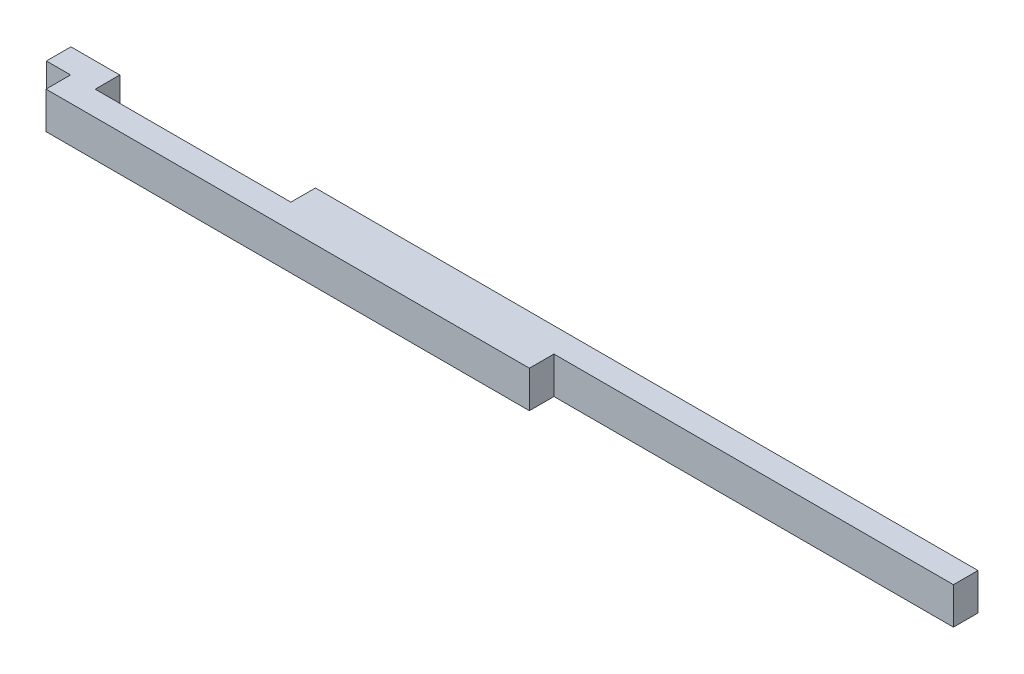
ISO-10303-21;
HEADER;
FILE_DESCRIPTION(('STEP AP214'),'2;1');
FILE_NAME('part.step','',(''),(''),'','','');
FILE_SCHEMA(('AUTOMOTIVE_DESIGN { 1 0 10303 214 1 1 1 1 }'));
ENDSEC;
DATA;
#1=APPLICATION_CONTEXT('core data for automotive mechanical design processes');
#2=APPLICATION_PROTOCOL_DEFINITION('international standard','automotive_design',2000,#1);
#3=PRODUCT_CONTEXT('',#1,'mechanical');
#4=PRODUCT('Part','Part','',(#3));
#5=PRODUCT_RELATED_PRODUCT_CATEGORY('part','',(#4));
#6=PRODUCT_DEFINITION_FORMATION('','',#4);
#7=PRODUCT_DEFINITION_CONTEXT('part definition',#1,'design');
#8=PRODUCT_DEFINITION('design','',#6,#7);
#9=PRODUCT_DEFINITION_SHAPE('','',#8);
#10=(LENGTH_UNIT() NAMED_UNIT(*) SI_UNIT(.MILLI.,.METRE.));
#11=(NAMED_UNIT(*) PLANE_ANGLE_UNIT() SI_UNIT($,.RADIAN.));
#12=(NAMED_UNIT(*) SI_UNIT($,.STERADIAN.) SOLID_ANGLE_UNIT());
#13=UNCERTAINTY_MEASURE_WITH_UNIT(LENGTH_MEASURE(1.E-05),#10,'distance_accuracy_value','');
#14=(GEOMETRIC_REPRESENTATION_CONTEXT(3) GLOBAL_UNCERTAINTY_ASSIGNED_CONTEXT((#13)) GLOBAL_UNIT_ASSIGNED_CONTEXT((#10,
#11,#12)) REPRESENTATION_CONTEXT('',''));
#15=CARTESIAN_POINT('',(0.,0.,0.));
#16=DIRECTION('',(0.,0.,1.));
#17=DIRECTION('',(1.,0.,0.));
#18=AXIS2_PLACEMENT_3D('',#15,#16,#17);
#19=CARTESIAN_POINT('',(0.,152.4,0.));
#20=DIRECTION('',(1.,0.,0.));
#21=DIRECTION('',(0.,0.,-1.));
#22=AXIS2_PLACEMENT_3D('',#19,#20,#21);
#23=PLANE('',#22);
#24=DIRECTION('',(0.,0.,1.));
#25=VECTOR('',#24,1.);
#26=CARTESIAN_POINT('',(0.,0.,0.));
#27=LINE('',#26,#25);
#28=CARTESIAN_POINT('',(0.,0.,-101.6));
#29=VERTEX_POINT('',#28);
#30=CARTESIAN_POINT('',(0.,0.,0.));
#31=VERTEX_POINT('',#30);
#32=EDGE_CURVE('E154',#29,#31,#27,.T.);
#33=ORIENTED_EDGE('',*,*,#32,.T.);
#34=DIRECTION('',(0.,-1.,0.));
#35=VECTOR('',#34,1.);
#36=CARTESIAN_POINT('',(0.,152.4,0.));
#37=LINE('',#36,#35);
#38=CARTESIAN_POINT('',(0.,152.4,0.));
#39=VERTEX_POINT('',#38);
#40=EDGE_CURVE('E11',#39,#31,#37,.T.);
#41=ORIENTED_EDGE('',*,*,#40,.F.);
#42=DIRECTION('',(0.,0.,1.));
#43=VECTOR('',#42,1.);
#44=CARTESIAN_POINT('',(0.,152.4,0.));
#45=LINE('',#44,#43);
#46=CARTESIAN_POINT('',(0.,152.4,-101.6));
#47=VERTEX_POINT('',#46);
#48=EDGE_CURVE('E177',#47,#39,#45,.T.);
#49=ORIENTED_EDGE('',*,*,#48,.F.);
#50=DIRECTION('',(0.,-1.,0.));
#51=VECTOR('',#50,1.);
#52=CARTESIAN_POINT('',(0.,152.4,-101.6));
#53=LINE('',#52,#51);
#54=EDGE_CURVE('E150',#47,#29,#53,.T.);
#55=ORIENTED_EDGE('',*,*,#54,.T.);
#56=EDGE_LOOP('',(#33,#41,#49,#55));
#57=FACE_BOUND('',#56,.T.);
#58=ADVANCED_FACE('F34',(#57),#23,.F.);
#59=CARTESIAN_POINT('',(0.,152.4,0.));
#60=DIRECTION('',(0.,0.,-1.));
#61=DIRECTION('',(-1.,0.,0.));
#62=AXIS2_PLACEMENT_3D('',#59,#60,#61);
#63=PLANE('',#62);
#64=DIRECTION('',(1.,0.,0.));
#65=VECTOR('',#64,1.);
#66=CARTESIAN_POINT('',(0.,0.,0.));
#67=LINE('',#66,#65);
#68=CARTESIAN_POINT('',(100.,0.,0.));
#69=VERTEX_POINT('',#68);
#70=EDGE_CURVE('E157',#31,#69,#67,.T.);
#71=ORIENTED_EDGE('',*,*,#70,.T.);
#72=DIRECTION('',(0.,-1.,0.));
#73=VECTOR('',#72,1.);
#74=CARTESIAN_POINT('',(100.,152.4,0.));
#75=LINE('',#74,#73);
#76=CARTESIAN_POINT('',(100.,152.4,0.));
#77=VERTEX_POINT('',#76);
#78=EDGE_CURVE('E42',#77,#69,#75,.T.);
#79=ORIENTED_EDGE('',*,*,#78,.F.);
#80=DIRECTION('',(1.,0.,0.));
#81=VECTOR('',#80,1.);
#82=CARTESIAN_POINT('',(0.,152.4,0.));
#83=LINE('',#82,#81);
#84=EDGE_CURVE('E105',#39,#77,#83,.T.);
#85=ORIENTED_EDGE('',*,*,#84,.F.);
#86=ORIENTED_EDGE('',*,*,#40,.T.);
#87=EDGE_LOOP('',(#71,#79,#85,#86));
#88=FACE_BOUND('',#87,.T.);
#89=ADVANCED_FACE('F254',(#88),#63,.F.);
#90=CARTESIAN_POINT('',(100.,152.4,0.));
#91=DIRECTION('',(1.,0.,0.));
#92=DIRECTION('',(0.,0.,-1.));
#93=AXIS2_PLACEMENT_3D('',#90,#91,#92);
#94=PLANE('',#93);
#95=DIRECTION('',(0.,0.,1.));
#96=VECTOR('',#95,1.);
#97=CARTESIAN_POINT('',(100.,0.,0.));
#98=LINE('',#97,#96);
#99=CARTESIAN_POINT('',(100.,0.,101.6));
#100=VERTEX_POINT('',#99);
#101=EDGE_CURVE('E159',#69,#100,#98,.T.);
#102=ORIENTED_EDGE('',*,*,#101,.T.);
#103=DIRECTION('',(0.,-1.,0.));
#104=VECTOR('',#103,1.);
#105=CARTESIAN_POINT('',(100.,152.4,101.6));
#106=LINE('',#105,#104);
#107=CARTESIAN_POINT('',(100.,152.4,101.6));
#108=VERTEX_POINT('',#107);
#109=EDGE_CURVE('E196',#108,#100,#106,.T.);
#110=ORIENTED_EDGE('',*,*,#109,.F.);
#111=DIRECTION('',(0.,0.,1.));
#112=VECTOR('',#111,1.);
#113=CARTESIAN_POINT('',(100.,152.4,0.));
#114=LINE('',#113,#112);
#115=EDGE_CURVE('E204',#77,#108,#114,.T.);
#116=ORIENTED_EDGE('',*,*,#115,.F.);
#117=ORIENTED_EDGE('',*,*,#78,.T.);
#118=EDGE_LOOP('',(#102,#110,#116,#117));
#119=FACE_BOUND('',#118,.T.);
#120=ADVANCED_FACE('F202',(#119),#94,.F.);
#121=CARTESIAN_POINT('',(1100.,152.4,101.6));
#122=DIRECTION('',(0.,0.,-1.));
#123=DIRECTION('',(-1.,0.,0.));
#124=AXIS2_PLACEMENT_3D('',#121,#122,#123);
#125=PLANE('',#124);
#126=DIRECTION('',(1.,0.,0.));
#127=VECTOR('',#126,1.);
#128=CARTESIAN_POINT('',(1100.,0.,101.6));
#129=LINE('',#128,#127);
#130=CARTESIAN_POINT('',(2100.,0.,101.6));
#131=VERTEX_POINT('',#130);
#132=EDGE_CURVE('E162',#100,#131,#129,.T.);
#133=ORIENTED_EDGE('',*,*,#132,.T.);
#134=DIRECTION('',(0.,-1.,0.));
#135=VECTOR('',#134,1.);
#136=CARTESIAN_POINT('',(2100.,152.4,101.6));
#137=LINE('',#136,#135);
#138=CARTESIAN_POINT('',(2100.,152.4,101.6));
#139=VERTEX_POINT('',#138);
#140=EDGE_CURVE('E193',#139,#131,#137,.T.);
#141=ORIENTED_EDGE('',*,*,#140,.F.);
#142=DIRECTION('',(1.,0.,0.));
#143=VECTOR('',#142,1.);
#144=CARTESIAN_POINT('',(100.,152.4,101.6));
#145=LINE('',#144,#143);
#146=EDGE_CURVE('E221',#108,#139,#145,.T.);
#147=ORIENTED_EDGE('',*,*,#146,.F.);
#148=ORIENTED_EDGE('',*,*,#109,.T.);
#149=EDGE_LOOP('',(#133,#141,#147,#148));
#150=FACE_BOUND('',#149,.T.);
#151=ADVANCED_FACE('F212',(#150),#125,.F.);
#152=CARTESIAN_POINT('',(2100.,152.4,0.));
#153=DIRECTION('',(-1.,0.,0.));
#154=DIRECTION('',(0.,0.,1.));
#155=AXIS2_PLACEMENT_3D('',#152,#153,#154);
#156=PLANE('',#155);
#157=DIRECTION('',(0.,0.,-1.));
#158=VECTOR('',#157,1.);
#159=CARTESIAN_POINT('',(2100.,0.,0.));
#160=LINE('',#159,#158);
#161=CARTESIAN_POINT('',(2100.,0.,0.));
#162=VERTEX_POINT('',#161);
#163=EDGE_CURVE('E164',#131,#162,#160,.T.);
#164=ORIENTED_EDGE('',*,*,#163,.T.);
#165=DIRECTION('',(0.,-1.,0.));
#166=VECTOR('',#165,1.);
#167=CARTESIAN_POINT('',(2100.,152.4,0.));
#168=LINE('',#167,#166);
#169=CARTESIAN_POINT('',(2100.,152.4,0.));
#170=VERTEX_POINT('',#169);
#171=EDGE_CURVE('E190',#170,#162,#168,.T.);
#172=ORIENTED_EDGE('',*,*,#171,.F.);
#173=DIRECTION('',(0.,0.,-1.));
#174=VECTOR('',#173,1.);
#175=CARTESIAN_POINT('',(2100.,152.4,0.));
#176=LINE('',#175,#174);
#177=EDGE_CURVE('E218',#139,#170,#176,.T.);
#178=ORIENTED_EDGE('',*,*,#177,.F.);
#179=ORIENTED_EDGE('',*,*,#140,.T.);
#180=EDGE_LOOP('',(#164,#172,#178,#179));
#181=FACE_BOUND('',#180,.T.);
#182=ADVANCED_FACE('F216',(#181),#156,.F.);
#183=CARTESIAN_POINT('',(2100.,152.4,0.));
#184=DIRECTION('',(0.,0.,-1.));
#185=DIRECTION('',(-1.,0.,0.));
#186=AXIS2_PLACEMENT_3D('',#183,#184,#185);
#187=PLANE('',#186);
#188=DIRECTION('',(1.,0.,0.));
#189=VECTOR('',#188,1.);
#190=CARTESIAN_POINT('',(2100.,0.,0.));
#191=LINE('',#190,#189);
#192=CARTESIAN_POINT('',(3752.9406,0.,0.));
#193=VERTEX_POINT('',#192);
#194=EDGE_CURVE('E166',#162,#193,#191,.T.);
#195=ORIENTED_EDGE('',*,*,#194,.T.);
#196=DIRECTION('',(0.,-1.,0.));
#197=VECTOR('',#196,1.);
#198=CARTESIAN_POINT('',(3752.9406,152.4,0.));
#199=LINE('',#198,#197);
#200=CARTESIAN_POINT('',(3752.9406,152.4,0.));
#201=VERTEX_POINT('',#200);
#202=EDGE_CURVE('E187',#201,#193,#199,.T.);
#203=ORIENTED_EDGE('',*,*,#202,.F.);
#204=DIRECTION('',(1.,0.,0.));
#205=VECTOR('',#204,1.);
#206=CARTESIAN_POINT('',(2100.,152.4,0.));
#207=LINE('',#206,#205);
#208=EDGE_CURVE('E220',#170,#201,#207,.T.);
#209=ORIENTED_EDGE('',*,*,#208,.F.);
#210=ORIENTED_EDGE('',*,*,#171,.T.);
#211=EDGE_LOOP('',(#195,#203,#209,#210));
#212=FACE_BOUND('',#211,.T.);
#213=ADVANCED_FACE('F267',(#212),#187,.F.);
#214=CARTESIAN_POINT('',(3752.9406,152.4,0.));
#215=DIRECTION('',(-1.,0.,0.));
#216=DIRECTION('',(0.,0.,1.));
#217=AXIS2_PLACEMENT_3D('',#214,#215,#216);
#218=PLANE('',#217);
#219=DIRECTION('',(0.,0.,-1.));
#220=VECTOR('',#219,1.);
#221=CARTESIAN_POINT('',(3752.9406,0.,0.));
#222=LINE('',#221,#220);
#223=CARTESIAN_POINT('',(3752.9406,0.,-101.6));
#224=VERTEX_POINT('',#223);
#225=EDGE_CURVE('E168',#193,#224,#222,.T.);
#226=ORIENTED_EDGE('',*,*,#225,.T.);
#227=DIRECTION('',(0.,-1.,0.));
#228=VECTOR('',#227,1.);
#229=CARTESIAN_POINT('',(3752.9406,152.4,-101.6));
#230=LINE('',#229,#228);
#231=CARTESIAN_POINT('',(3752.9406,152.4,-101.6));
#232=VERTEX_POINT('',#231);
#233=EDGE_CURVE('E184',#232,#224,#230,.T.);
#234=ORIENTED_EDGE('',*,*,#233,.F.);
#235=DIRECTION('',(0.,0.,-1.));
#236=VECTOR('',#235,1.);
#237=CARTESIAN_POINT('',(3752.9406,152.4,0.));
#238=LINE('',#237,#236);
#239=EDGE_CURVE('E223',#201,#232,#238,.T.);
#240=ORIENTED_EDGE('',*,*,#239,.F.);
#241=ORIENTED_EDGE('',*,*,#202,.T.);
#242=EDGE_LOOP('',(#226,#234,#240,#241));
#243=FACE_BOUND('',#242,.T.);
#244=ADVANCED_FACE('F270',(#243),#218,.F.);
#245=CARTESIAN_POINT('',(1011.56,152.4,-101.6));
#246=DIRECTION('',(0.,0.,1.));
#247=DIRECTION('',(1.,0.,0.));
#248=AXIS2_PLACEMENT_3D('',#245,#246,#247);
#249=PLANE('',#248);
#250=DIRECTION('',(-1.,0.,0.));
#251=VECTOR('',#250,1.);
#252=CARTESIAN_POINT('',(1011.56,0.,-101.6));
#253=LINE('',#252,#251);
#254=CARTESIAN_POINT('',(1011.56,0.,-101.6));
#255=VERTEX_POINT('',#254);
#256=EDGE_CURVE('E170',#224,#255,#253,.T.);
#257=ORIENTED_EDGE('',*,*,#256,.T.);
#258=DIRECTION('',(0.,-1.,0.));
#259=VECTOR('',#258,1.);
#260=CARTESIAN_POINT('',(1011.56,152.4,-101.6));
#261=LINE('',#260,#259);
#262=CARTESIAN_POINT('',(1011.56,152.4,-101.6));
#263=VERTEX_POINT('',#262);
#264=EDGE_CURVE('E181',#263,#255,#261,.T.);
#265=ORIENTED_EDGE('',*,*,#264,.F.);
#266=DIRECTION('',(-1.,0.,0.));
#267=VECTOR('',#266,1.);
#268=CARTESIAN_POINT('',(1011.56,152.4,-101.6));
#269=LINE('',#268,#267);
#270=EDGE_CURVE('E229',#232,#263,#269,.T.);
#271=ORIENTED_EDGE('',*,*,#270,.F.);
#272=ORIENTED_EDGE('',*,*,#233,.T.);
#273=EDGE_LOOP('',(#257,#265,#271,#272));
#274=FACE_BOUND('',#273,.T.);
#275=ADVANCED_FACE('F235',(#274),#249,.F.);
#276=CARTESIAN_POINT('',(1011.56,152.4,0.));
#277=DIRECTION('',(1.,0.,0.));
#278=DIRECTION('',(0.,0.,-1.));
#279=AXIS2_PLACEMENT_3D('',#276,#277,#278);
#280=PLANE('',#279);
#281=DIRECTION('',(0.,0.,1.));
#282=VECTOR('',#281,1.);
#283=CARTESIAN_POINT('',(1011.56,0.,0.));
#284=LINE('',#283,#282);
#285=CARTESIAN_POINT('',(1011.56,0.,0.));
#286=VERTEX_POINT('',#285);
#287=EDGE_CURVE('E172',#255,#286,#284,.T.);
#288=ORIENTED_EDGE('',*,*,#287,.T.);
#289=DIRECTION('',(0.,-1.,0.));
#290=VECTOR('',#289,1.);
#291=CARTESIAN_POINT('',(1011.56,152.4,0.));
#292=LINE('',#291,#290);
#293=CARTESIAN_POINT('',(1011.56,152.4,0.));
#294=VERTEX_POINT('',#293);
#295=EDGE_CURVE('E145',#294,#286,#292,.T.);
#296=ORIENTED_EDGE('',*,*,#295,.F.);
#297=DIRECTION('',(0.,0.,1.));
#298=VECTOR('',#297,1.);
#299=CARTESIAN_POINT('',(1011.56,152.4,0.));
#300=LINE('',#299,#298);
#301=EDGE_CURVE('E136',#263,#294,#300,.T.);
#302=ORIENTED_EDGE('',*,*,#301,.F.);
#303=ORIENTED_EDGE('',*,*,#264,.T.);
#304=EDGE_LOOP('',(#288,#296,#302,#303));
#305=FACE_BOUND('',#304,.T.);
#306=ADVANCED_FACE('F239',(#305),#280,.F.);
#307=CARTESIAN_POINT('',(202.,152.4,0.));
#308=DIRECTION('',(0.,0.,1.));
#309=DIRECTION('',(1.,0.,0.));
#310=AXIS2_PLACEMENT_3D('',#307,#308,#309);
#311=PLANE('',#310);
#312=DIRECTION('',(-1.,0.,0.));
#313=VECTOR('',#312,1.);
#314=CARTESIAN_POINT('',(202.,0.,0.));
#315=LINE('',#314,#313);
#316=CARTESIAN_POINT('',(202.,0.,0.));
#317=VERTEX_POINT('',#316);
#318=EDGE_CURVE('E144',#286,#317,#315,.T.);
#319=ORIENTED_EDGE('',*,*,#318,.T.);
#320=DIRECTION('',(0.,-1.,0.));
#321=VECTOR('',#320,1.);
#322=CARTESIAN_POINT('',(202.,152.4,0.));
#323=LINE('',#322,#321);
#324=CARTESIAN_POINT('',(202.,152.4,0.));
#325=VERTEX_POINT('',#324);
#326=EDGE_CURVE('E141',#325,#317,#323,.T.);
#327=ORIENTED_EDGE('',*,*,#326,.F.);
#328=DIRECTION('',(-1.,0.,0.));
#329=VECTOR('',#328,1.);
#330=CARTESIAN_POINT('',(202.,152.4,0.));
#331=LINE('',#330,#329);
#332=EDGE_CURVE('E130',#294,#325,#331,.T.);
#333=ORIENTED_EDGE('',*,*,#332,.F.);
#334=ORIENTED_EDGE('',*,*,#295,.T.);
#335=EDGE_LOOP('',(#319,#327,#333,#334));
#336=FACE_BOUND('',#335,.T.);
#337=ADVANCED_FACE('F142',(#336),#311,.F.);
#338=CARTESIAN_POINT('',(202.,152.4,-101.6));
#339=DIRECTION('',(-1.,0.,0.));
#340=DIRECTION('',(0.,0.,1.));
#341=AXIS2_PLACEMENT_3D('',#338,#339,#340);
#342=PLANE('',#341);
#343=DIRECTION('',(0.,0.,-1.));
#344=VECTOR('',#343,1.);
#345=CARTESIAN_POINT('',(202.,0.,-101.6));
#346=LINE('',#345,#344);
#347=CARTESIAN_POINT('',(202.,0.,-101.6));
#348=VERTEX_POINT('',#347);
#349=EDGE_CURVE('E91',#317,#348,#346,.T.);
#350=ORIENTED_EDGE('',*,*,#349,.T.);
#351=DIRECTION('',(0.,-1.,0.));
#352=VECTOR('',#351,1.);
#353=CARTESIAN_POINT('',(202.,152.4,-101.6));
#354=LINE('',#353,#352);
#355=CARTESIAN_POINT('',(202.,152.4,-101.6));
#356=VERTEX_POINT('',#355);
#357=EDGE_CURVE('E146',#356,#348,#354,.T.);
#358=ORIENTED_EDGE('',*,*,#357,.F.);
#359=DIRECTION('',(0.,0.,-1.));
#360=VECTOR('',#359,1.);
#361=CARTESIAN_POINT('',(202.,152.4,-101.6));
#362=LINE('',#361,#360);
#363=EDGE_CURVE('E134',#325,#356,#362,.T.);
#364=ORIENTED_EDGE('',*,*,#363,.F.);
#365=ORIENTED_EDGE('',*,*,#326,.T.);
#366=EDGE_LOOP('',(#350,#358,#364,#365));
#367=FACE_BOUND('',#366,.T.);
#368=ADVANCED_FACE('F148',(#367),#342,.F.);
#369=CARTESIAN_POINT('',(0.,152.4,-101.6));
#370=DIRECTION('',(0.,0.,1.));
#371=DIRECTION('',(1.,0.,0.));
#372=AXIS2_PLACEMENT_3D('',#369,#370,#371);
#373=PLANE('',#372);
#374=DIRECTION('',(-1.,0.,0.));
#375=VECTOR('',#374,1.);
#376=CARTESIAN_POINT('',(0.,0.,-101.6));
#377=LINE('',#376,#375);
#378=EDGE_CURVE('E97',#348,#29,#377,.T.);
#379=ORIENTED_EDGE('',*,*,#378,.T.);
#380=ORIENTED_EDGE('',*,*,#54,.F.);
#381=DIRECTION('',(-1.,0.,0.));
#382=VECTOR('',#381,1.);
#383=CARTESIAN_POINT('',(0.,152.4,-101.6));
#384=LINE('',#383,#382);
#385=EDGE_CURVE('E50',#356,#47,#384,.T.);
#386=ORIENTED_EDGE('',*,*,#385,.F.);
#387=ORIENTED_EDGE('',*,*,#357,.T.);
#388=EDGE_LOOP('',(#379,#380,#386,#387));
#389=FACE_BOUND('',#388,.T.);
#390=ADVANCED_FACE('F243',(#389),#373,.F.);
#391=CARTESIAN_POINT('',(0.,152.4,-101.6));
#392=DIRECTION('',(0.,-1.,0.));
#393=DIRECTION('',(0.,0.,-1.));
#394=AXIS2_PLACEMENT_3D('',#391,#392,#393);
#395=PLANE('',#394);
#396=ORIENTED_EDGE('',*,*,#48,.T.);
#397=ORIENTED_EDGE('',*,*,#84,.T.);
#398=ORIENTED_EDGE('',*,*,#115,.T.);
#399=ORIENTED_EDGE('',*,*,#146,.T.);
#400=ORIENTED_EDGE('',*,*,#177,.T.);
#401=ORIENTED_EDGE('',*,*,#208,.T.);
#402=ORIENTED_EDGE('',*,*,#239,.T.);
#403=ORIENTED_EDGE('',*,*,#270,.T.);
#404=ORIENTED_EDGE('',*,*,#301,.T.);
#405=ORIENTED_EDGE('',*,*,#332,.T.);
#406=ORIENTED_EDGE('',*,*,#363,.T.);
#407=ORIENTED_EDGE('',*,*,#385,.T.);
#408=EDGE_LOOP('',(#396,#397,#398,#399,#400,#401,#402,#403,#404,#405,#406,#407));
#409=FACE_BOUND('',#408,.T.);
#410=ADVANCED_FACE('F132',(#409),#395,.F.);
#411=CARTESIAN_POINT('',(0.,0.,-101.6));
#412=DIRECTION('',(0.,-1.,0.));
#413=DIRECTION('',(0.,0.,-1.));
#414=AXIS2_PLACEMENT_3D('',#411,#412,#413);
#415=PLANE('',#414);
#416=ORIENTED_EDGE('',*,*,#32,.F.);
#417=ORIENTED_EDGE('',*,*,#378,.F.);
#418=ORIENTED_EDGE('',*,*,#349,.F.);
#419=ORIENTED_EDGE('',*,*,#318,.F.);
#420=ORIENTED_EDGE('',*,*,#287,.F.);
#421=ORIENTED_EDGE('',*,*,#256,.F.);
#422=ORIENTED_EDGE('',*,*,#225,.F.);
#423=ORIENTED_EDGE('',*,*,#194,.F.);
#424=ORIENTED_EDGE('',*,*,#163,.F.);
#425=ORIENTED_EDGE('',*,*,#132,.F.);
#426=ORIENTED_EDGE('',*,*,#101,.F.);
#427=ORIENTED_EDGE('',*,*,#70,.F.);
#428=EDGE_LOOP('',(#416,#417,#418,#419,#420,#421,#422,#423,#424,#425,#426,#427));
#429=FACE_BOUND('',#428,.T.);
#430=ADVANCED_FACE('F207',(#429),#415,.T.);
#431=CLOSED_SHELL('',(#58,#89,#120,#151,#182,#213,#244,#275,#306,#337,#368,#390,#410,#430));
#432=MANIFOLD_SOLID_BREP('B2',#431);
#433=ADVANCED_BREP_SHAPE_REPRESENTATION('',(#18,#432),#14);
#434=SHAPE_DEFINITION_REPRESENTATION(#9,#433);
ENDSEC;
END-ISO-10303-21;
